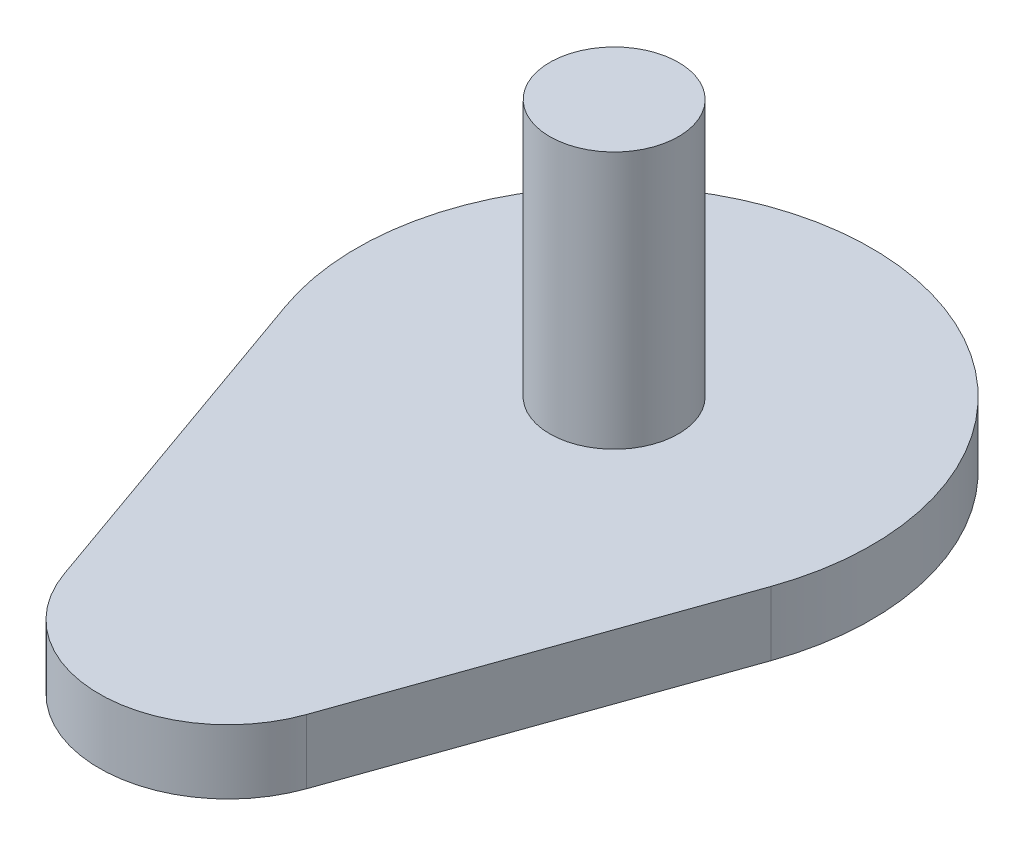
ISO-10303-21;
HEADER;
FILE_DESCRIPTION(('STEP AP214'),'2;1');
FILE_NAME('part.step','',(''),(''),'','','');
FILE_SCHEMA(('AUTOMOTIVE_DESIGN { 1 0 10303 214 1 1 1 1 }'));
ENDSEC;
DATA;
#1=APPLICATION_CONTEXT('core data for automotive mechanical design processes');
#2=APPLICATION_PROTOCOL_DEFINITION('international standard','automotive_design',2000,#1);
#3=PRODUCT_CONTEXT('',#1,'mechanical');
#4=PRODUCT('Part','Part','',(#3));
#5=PRODUCT_RELATED_PRODUCT_CATEGORY('part','',(#4));
#6=PRODUCT_DEFINITION_FORMATION('','',#4);
#7=PRODUCT_DEFINITION_CONTEXT('part definition',#1,'design');
#8=PRODUCT_DEFINITION('design','',#6,#7);
#9=PRODUCT_DEFINITION_SHAPE('','',#8);
#10=(LENGTH_UNIT() NAMED_UNIT(*) SI_UNIT(.MILLI.,.METRE.));
#11=(NAMED_UNIT(*) PLANE_ANGLE_UNIT() SI_UNIT($,.RADIAN.));
#12=(NAMED_UNIT(*) SI_UNIT($,.STERADIAN.) SOLID_ANGLE_UNIT());
#13=UNCERTAINTY_MEASURE_WITH_UNIT(LENGTH_MEASURE(1.E-05),#10,'distance_accuracy_value','');
#14=(GEOMETRIC_REPRESENTATION_CONTEXT(3) GLOBAL_UNCERTAINTY_ASSIGNED_CONTEXT((#13)) GLOBAL_UNIT_ASSIGNED_CONTEXT((#10,
#11,#12)) REPRESENTATION_CONTEXT('',''));
#15=CARTESIAN_POINT('',(0.,0.,0.));
#16=DIRECTION('',(0.,0.,1.));
#17=DIRECTION('',(1.,0.,0.));
#18=AXIS2_PLACEMENT_3D('',#15,#16,#17);
#19=CARTESIAN_POINT('',(-9.61032221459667,22.5,-2.49017454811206));
#20=DIRECTION('',(0.,-1.,0.));
#21=DIRECTION('',(0.,0.,-1.));
#22=AXIS2_PLACEMENT_3D('',#19,#20,#21);
#23=PLANE('',#22);
#24=CARTESIAN_POINT('',(-9.61032221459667,22.5,-2.49017454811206));
#25=DIRECTION('',(0.,1.,0.));
#26=DIRECTION('',(0.,0.,1.));
#27=AXIS2_PLACEMENT_3D('',#24,#25,#26);
#28=CIRCLE('',#27,5.);
#29=CARTESIAN_POINT('',(-9.61032221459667,22.5,2.50982545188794));
#30=VERTEX_POINT('',#29);
#31=EDGE_CURVE('E18',#30,#30,#28,.F.);
#32=ORIENTED_EDGE('',*,*,#31,.F.);
#33=EDGE_LOOP('',(#32));
#34=FACE_BOUND('',#33,.T.);
#35=ADVANCED_FACE('F14',(#34),#23,.F.);
#36=CARTESIAN_POINT('',(-9.61032221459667,2.5,-2.49017454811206));
#37=DIRECTION('',(0.,1.,0.));
#38=DIRECTION('',(0.,0.,1.));
#39=AXIS2_PLACEMENT_3D('',#36,#37,#38);
#40=CYLINDRICAL_SURFACE('',#39,5.);
#41=ORIENTED_EDGE('',*,*,#31,.T.);
#42=EDGE_LOOP('',(#41));
#43=FACE_BOUND('',#42,.T.);
#44=CARTESIAN_POINT('',(-9.61032221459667,2.5,-2.49017454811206));
#45=DIRECTION('',(0.,1.,0.));
#46=DIRECTION('',(0.,0.,1.));
#47=AXIS2_PLACEMENT_3D('',#44,#45,#46);
#48=CIRCLE('',#47,5.);
#49=CARTESIAN_POINT('',(-9.61032221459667,2.5,2.50982545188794));
#50=VERTEX_POINT('',#49);
#51=EDGE_CURVE('E71',#50,#50,#48,.F.);
#52=ORIENTED_EDGE('',*,*,#51,.F.);
#53=EDGE_LOOP('',(#52));
#54=FACE_BOUND('',#53,.T.);
#55=ADVANCED_FACE('F93',(#43,#54),#40,.T.);
#56=CARTESIAN_POINT('',(-9.61032221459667,2.5,6.49996282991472));
#57=DIRECTION('',(0.,1.,0.));
#58=DIRECTION('',(0.,0.,1.));
#59=AXIS2_PLACEMENT_3D('',#56,#57,#58);
#60=PLANE('',#59);
#61=ORIENTED_EDGE('',*,*,#51,.T.);
#62=EDGE_LOOP('',(#61));
#63=FACE_BOUND('',#62,.T.);
#64=DIRECTION('',(0.333333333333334,0.,0.942809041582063));
#65=VECTOR('',#64,1.);
#66=CARTESIAN_POINT('',(-19.0384126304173,2.5,30.8431587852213));
#67=LINE('',#66,#65);
#68=CARTESIAN_POINT('',(-19.0384126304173,2.5,30.8431587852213));
#69=VERTEX_POINT('',#68);
#70=CARTESIAN_POINT('',(-28.466503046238,2.5,4.17649211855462));
#71=VERTEX_POINT('',#70);
#72=EDGE_CURVE('E67',#69,#71,#67,.F.);
#73=ORIENTED_EDGE('',*,*,#72,.F.);
#74=CARTESIAN_POINT('',(-9.61032221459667,2.5,27.5098254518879));
#75=DIRECTION('',(0.,1.,0.));
#76=DIRECTION('',(0.,0.,1.));
#77=AXIS2_PLACEMENT_3D('',#74,#75,#76);
#78=CIRCLE('',#77,10.);
#79=CARTESIAN_POINT('',(-0.182231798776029,2.5,30.8431587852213));
#80=VERTEX_POINT('',#79);
#81=EDGE_CURVE('E62',#80,#69,#78,.F.);
#82=ORIENTED_EDGE('',*,*,#81,.F.);
#83=DIRECTION('',(0.333333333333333,0.,-0.942809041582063));
#84=VECTOR('',#83,1.);
#85=CARTESIAN_POINT('',(9.2458586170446,2.5,4.17649211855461));
#86=LINE('',#85,#84);
#87=CARTESIAN_POINT('',(9.2458586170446,2.5,4.17649211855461));
#88=VERTEX_POINT('',#87);
#89=EDGE_CURVE('E52',#88,#80,#86,.F.);
#90=ORIENTED_EDGE('',*,*,#89,.F.);
#91=CARTESIAN_POINT('',(-9.61032221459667,2.5,-2.49017454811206));
#92=DIRECTION('',(0.,1.,0.));
#93=DIRECTION('',(0.,0.,1.));
#94=AXIS2_PLACEMENT_3D('',#91,#92,#93);
#95=CIRCLE('',#94,20.);
#96=EDGE_CURVE('E77',#71,#88,#95,.F.);
#97=ORIENTED_EDGE('',*,*,#96,.F.);
#98=EDGE_LOOP('',(#73,#82,#90,#97));
#99=FACE_BOUND('',#98,.T.);
#100=ADVANCED_FACE('F66',(#63,#99),#60,.T.);
#101=CARTESIAN_POINT('',(-9.61032221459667,0.,27.5098254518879));
#102=DIRECTION('',(0.,1.,0.));
#103=DIRECTION('',(0.,0.,1.));
#104=AXIS2_PLACEMENT_3D('',#101,#102,#103);
#105=CYLINDRICAL_SURFACE('',#104,10.);
#106=CARTESIAN_POINT('',(-9.61032221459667,-2.5,27.5098254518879));
#107=DIRECTION('',(0.,1.,0.));
#108=DIRECTION('',(0.,0.,1.));
#109=AXIS2_PLACEMENT_3D('',#106,#107,#108);
#110=CIRCLE('',#109,10.);
#111=CARTESIAN_POINT('',(-19.0384126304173,-2.5,30.8431587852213));
#112=VERTEX_POINT('',#111);
#113=CARTESIAN_POINT('',(-0.182231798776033,-2.5,30.8431587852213));
#114=VERTEX_POINT('',#113);
#115=EDGE_CURVE('E75',#112,#114,#110,.T.);
#116=ORIENTED_EDGE('',*,*,#115,.T.);
#117=DIRECTION('',(0.,1.,0.));
#118=VECTOR('',#117,1.);
#119=CARTESIAN_POINT('',(-0.182231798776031,0.,30.8431587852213));
#120=LINE('',#119,#118);
#121=EDGE_CURVE('E57',#80,#114,#120,.F.);
#122=ORIENTED_EDGE('',*,*,#121,.F.);
#123=ORIENTED_EDGE('',*,*,#81,.T.);
#124=DIRECTION('',(0.,1.,0.));
#125=VECTOR('',#124,1.);
#126=CARTESIAN_POINT('',(-19.0384126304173,0.,30.8431587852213));
#127=LINE('',#126,#125);
#128=EDGE_CURVE('E86',#112,#69,#127,.T.);
#129=ORIENTED_EDGE('',*,*,#128,.F.);
#130=EDGE_LOOP('',(#116,#122,#123,#129));
#131=FACE_BOUND('',#130,.T.);
#132=ADVANCED_FACE('F74',(#131),#105,.T.);
#133=CARTESIAN_POINT('',(9.2458586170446,0.,4.17649211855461));
#134=DIRECTION('',(0.942809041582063,0.,0.333333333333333));
#135=DIRECTION('',(0.333333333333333,0.,-0.942809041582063));
#136=AXIS2_PLACEMENT_3D('',#133,#134,#135);
#137=PLANE('',#136);
#138=DIRECTION('',(0.333333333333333,0.,-0.942809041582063));
#139=VECTOR('',#138,1.);
#140=CARTESIAN_POINT('',(-0.182231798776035,-2.5,30.8431587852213));
#141=LINE('',#140,#139);
#142=CARTESIAN_POINT('',(9.2458586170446,-2.5,4.17649211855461));
#143=VERTEX_POINT('',#142);
#144=EDGE_CURVE('E84',#114,#143,#141,.T.);
#145=ORIENTED_EDGE('',*,*,#144,.T.);
#146=DIRECTION('',(0.,1.,0.));
#147=VECTOR('',#146,1.);
#148=CARTESIAN_POINT('',(9.2458586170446,0.,4.17649211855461));
#149=LINE('',#148,#147);
#150=EDGE_CURVE('E59',#88,#143,#149,.F.);
#151=ORIENTED_EDGE('',*,*,#150,.F.);
#152=ORIENTED_EDGE('',*,*,#89,.T.);
#153=ORIENTED_EDGE('',*,*,#121,.T.);
#154=EDGE_LOOP('',(#145,#151,#152,#153));
#155=FACE_BOUND('',#154,.T.);
#156=ADVANCED_FACE('F55',(#155),#137,.T.);
#157=CARTESIAN_POINT('',(-9.61032221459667,0.,-2.49017454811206));
#158=DIRECTION('',(0.,1.,0.));
#159=DIRECTION('',(0.,0.,1.));
#160=AXIS2_PLACEMENT_3D('',#157,#158,#159);
#161=CYLINDRICAL_SURFACE('',#160,20.);
#162=DIRECTION('',(0.,1.,0.));
#163=VECTOR('',#162,1.);
#164=CARTESIAN_POINT('',(-28.466503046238,0.,4.17649211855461));
#165=LINE('',#164,#163);
#166=CARTESIAN_POINT('',(-28.466503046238,-2.5,4.17649211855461));
#167=VERTEX_POINT('',#166);
#168=EDGE_CURVE('E81',#71,#167,#165,.F.);
#169=ORIENTED_EDGE('',*,*,#168,.F.);
#170=ORIENTED_EDGE('',*,*,#96,.T.);
#171=ORIENTED_EDGE('',*,*,#150,.T.);
#172=CARTESIAN_POINT('',(-9.61032221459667,-2.5,-2.49017454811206));
#173=DIRECTION('',(0.,1.,0.));
#174=DIRECTION('',(0.,0.,1.));
#175=AXIS2_PLACEMENT_3D('',#172,#173,#174);
#176=CIRCLE('',#175,20.);
#177=EDGE_CURVE('E24',#143,#167,#176,.T.);
#178=ORIENTED_EDGE('',*,*,#177,.T.);
#179=EDGE_LOOP('',(#169,#170,#171,#178));
#180=FACE_BOUND('',#179,.T.);
#181=ADVANCED_FACE('F111',(#180),#161,.T.);
#182=CARTESIAN_POINT('',(-19.0384126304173,0.,30.8431587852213));
#183=DIRECTION('',(-0.942809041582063,0.,0.333333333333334));
#184=DIRECTION('',(0.333333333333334,0.,0.942809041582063));
#185=AXIS2_PLACEMENT_3D('',#182,#183,#184);
#186=PLANE('',#185);
#187=DIRECTION('',(0.333333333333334,0.,0.942809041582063));
#188=VECTOR('',#187,1.);
#189=CARTESIAN_POINT('',(-28.466503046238,-2.5,4.17649211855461));
#190=LINE('',#189,#188);
#191=EDGE_CURVE('E9',#167,#112,#190,.T.);
#192=ORIENTED_EDGE('',*,*,#191,.T.);
#193=ORIENTED_EDGE('',*,*,#128,.T.);
#194=ORIENTED_EDGE('',*,*,#72,.T.);
#195=ORIENTED_EDGE('',*,*,#168,.T.);
#196=EDGE_LOOP('',(#192,#193,#194,#195));
#197=FACE_BOUND('',#196,.T.);
#198=ADVANCED_FACE('F105',(#197),#186,.T.);
#199=CARTESIAN_POINT('',(-9.61032221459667,-2.5,6.49996282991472));
#200=DIRECTION('',(0.,1.,0.));
#201=DIRECTION('',(0.,0.,1.));
#202=AXIS2_PLACEMENT_3D('',#199,#200,#201);
#203=PLANE('',#202);
#204=ORIENTED_EDGE('',*,*,#191,.F.);
#205=ORIENTED_EDGE('',*,*,#177,.F.);
#206=ORIENTED_EDGE('',*,*,#144,.F.);
#207=ORIENTED_EDGE('',*,*,#115,.F.);
#208=EDGE_LOOP('',(#204,#205,#206,#207));
#209=FACE_BOUND('',#208,.T.);
#210=ADVANCED_FACE('F16',(#209),#203,.F.);
#211=CLOSED_SHELL('',(#35,#55,#100,#132,#156,#181,#198,#210));
#212=MANIFOLD_SOLID_BREP('B1',#211);
#213=ADVANCED_BREP_SHAPE_REPRESENTATION('',(#18,#212),#14);
#214=SHAPE_DEFINITION_REPRESENTATION(#9,#213);
ENDSEC;
END-ISO-10303-21;
